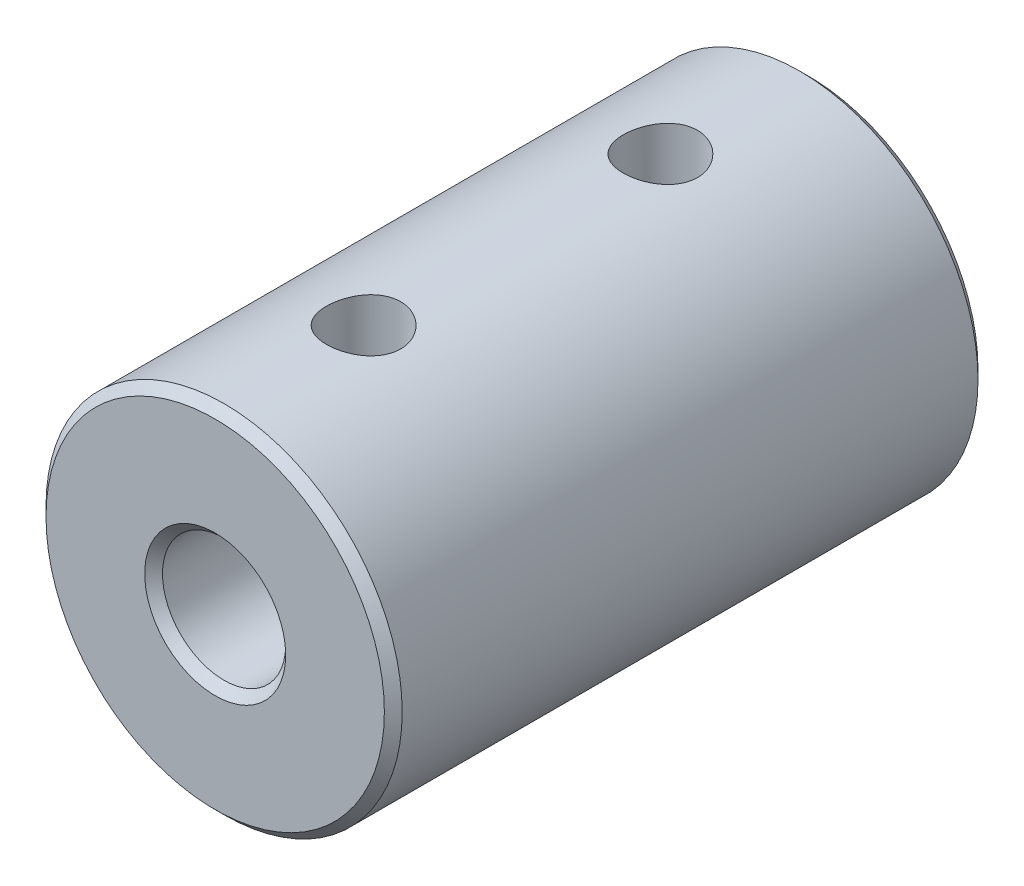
from build123d import *

# Parameters (mm, degrees)
ESQUISSE1_R             = 6
ESQUISSE1_R_2           = 2.075
BOSS_EXTRU_1_DEPTH      = 10
ESQUISSE3_R             = 1.25
ENL_V_MAT_EXTRU_2_DEPTH = 6
CHANFREIN1_SIZE         = 0.3


with BuildPart() as part:
    # Esquisse1 → Boss.-Extru.1 (new, symmetric)
    with BuildSketch(Plane.XY):
        Circle(ESQUISSE1_R)
        Circle(ESQUISSE1_R_2, mode=Mode.SUBTRACT)
    extrude(amount=BOSS_EXTRU_1_DEPTH, both=True)

    # Esquisse3 → Enl_v. mat.-Extru.2 (cut, symmetric)
    with BuildSketch(Plane(origin=(0, 0, 0), x_dir=(-1, 0, 0), z_dir=(0, 1, 0))):
        with Locations(Location((0, 5, 0), (0, 0, 90))):
            Circle(ESQUISSE3_R)
        with Locations(Location((0, -5, 0), (0, 0, 90))):
            Circle(ESQUISSE3_R)
    extrude(amount=ENL_V_MAT_EXTRU_2_DEPTH, both=True, mode=Mode.SUBTRACT)

    # Chanfrein1
    chanfrein1_edges = [part.edges().sort_by_distance(p)[0] for p in [
        (-6, 0, -10),
        (-6, 0, 10),
        (-2.075, 0, -10),
        (-2.075, 0, 10),
    ]]
    chamfer(chanfrein1_edges, length=CHANFREIN1_SIZE)


solid = part.part
